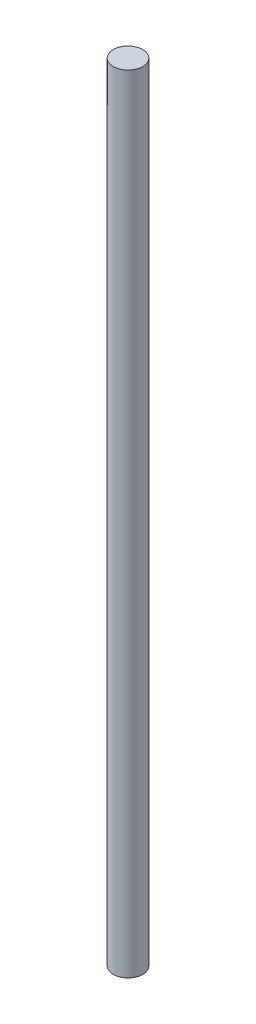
ISO-10303-21;
HEADER;
FILE_DESCRIPTION(('STEP AP214'),'2;1');
FILE_NAME('part.step','',(''),(''),'','','');
FILE_SCHEMA(('AUTOMOTIVE_DESIGN { 1 0 10303 214 1 1 1 1 }'));
ENDSEC;
DATA;
#1=APPLICATION_CONTEXT('core data for automotive mechanical design processes');
#2=APPLICATION_PROTOCOL_DEFINITION('international standard','automotive_design',2000,#1);
#3=PRODUCT_CONTEXT('',#1,'mechanical');
#4=PRODUCT('Part','Part','',(#3));
#5=PRODUCT_RELATED_PRODUCT_CATEGORY('part','',(#4));
#6=PRODUCT_DEFINITION_FORMATION('','',#4);
#7=PRODUCT_DEFINITION_CONTEXT('part definition',#1,'design');
#8=PRODUCT_DEFINITION('design','',#6,#7);
#9=PRODUCT_DEFINITION_SHAPE('','',#8);
#10=(LENGTH_UNIT() NAMED_UNIT(*) SI_UNIT(.MILLI.,.METRE.));
#11=(NAMED_UNIT(*) PLANE_ANGLE_UNIT() SI_UNIT($,.RADIAN.));
#12=(NAMED_UNIT(*) SI_UNIT($,.STERADIAN.) SOLID_ANGLE_UNIT());
#13=UNCERTAINTY_MEASURE_WITH_UNIT(LENGTH_MEASURE(1.E-05),#10,'distance_accuracy_value','');
#14=(GEOMETRIC_REPRESENTATION_CONTEXT(3) GLOBAL_UNCERTAINTY_ASSIGNED_CONTEXT((#13)) GLOBAL_UNIT_ASSIGNED_CONTEXT((#10,
#11,#12)) REPRESENTATION_CONTEXT('',''));
#15=CARTESIAN_POINT('',(0.,0.,0.));
#16=DIRECTION('',(0.,0.,1.));
#17=DIRECTION('',(1.,0.,0.));
#18=AXIS2_PLACEMENT_3D('',#15,#16,#17);
#19=CARTESIAN_POINT('',(0.,160.,0.));
#20=DIRECTION('',(0.,1.,0.));
#21=DIRECTION('',(0.,0.,1.));
#22=AXIS2_PLACEMENT_3D('',#19,#20,#21);
#23=PLANE('',#22);
#24=CARTESIAN_POINT('',(0.,160.,0.));
#25=DIRECTION('',(0.,-1.,0.));
#26=DIRECTION('',(0.,0.,-1.));
#27=AXIS2_PLACEMENT_3D('',#24,#25,#26);
#28=CIRCLE('',#27,3.);
#29=CARTESIAN_POINT('',(0.,160.,-3.));
#30=VERTEX_POINT('',#29);
#31=EDGE_CURVE('E18',#30,#30,#28,.T.);
#32=ORIENTED_EDGE('',*,*,#31,.F.);
#33=EDGE_LOOP('',(#32));
#34=FACE_BOUND('',#33,.T.);
#35=ADVANCED_FACE('F15',(#34),#23,.T.);
#36=CARTESIAN_POINT('',(0.,0.,0.));
#37=DIRECTION('',(0.,1.,0.));
#38=DIRECTION('',(0.,0.,1.));
#39=AXIS2_PLACEMENT_3D('',#36,#37,#38);
#40=PLANE('',#39);
#41=CARTESIAN_POINT('',(0.,0.,0.));
#42=DIRECTION('',(0.,-1.,0.));
#43=DIRECTION('',(0.,0.,-1.));
#44=AXIS2_PLACEMENT_3D('',#41,#42,#43);
#45=CIRCLE('',#44,3.);
#46=CARTESIAN_POINT('',(0.,0.,-3.));
#47=VERTEX_POINT('',#46);
#48=EDGE_CURVE('E10',#47,#47,#45,.F.);
#49=ORIENTED_EDGE('',*,*,#48,.F.);
#50=EDGE_LOOP('',(#49));
#51=FACE_BOUND('',#50,.T.);
#52=ADVANCED_FACE('F30',(#51),#40,.F.);
#53=CARTESIAN_POINT('',(0.,160.,0.));
#54=DIRECTION('',(0.,-1.,0.));
#55=DIRECTION('',(0.,0.,-1.));
#56=AXIS2_PLACEMENT_3D('',#53,#54,#55);
#57=CYLINDRICAL_SURFACE('',#56,3.);
#58=ORIENTED_EDGE('',*,*,#48,.T.);
#59=EDGE_LOOP('',(#58));
#60=FACE_BOUND('',#59,.T.);
#61=ORIENTED_EDGE('',*,*,#31,.T.);
#62=EDGE_LOOP('',(#61));
#63=FACE_BOUND('',#62,.T.);
#64=ADVANCED_FACE('F27',(#60,#63),#57,.T.);
#65=CLOSED_SHELL('',(#35,#52,#64));
#66=MANIFOLD_SOLID_BREP('B1',#65);
#67=ADVANCED_BREP_SHAPE_REPRESENTATION('',(#18,#66),#14);
#68=SHAPE_DEFINITION_REPRESENTATION(#9,#67);
ENDSEC;
END-ISO-10303-21;
